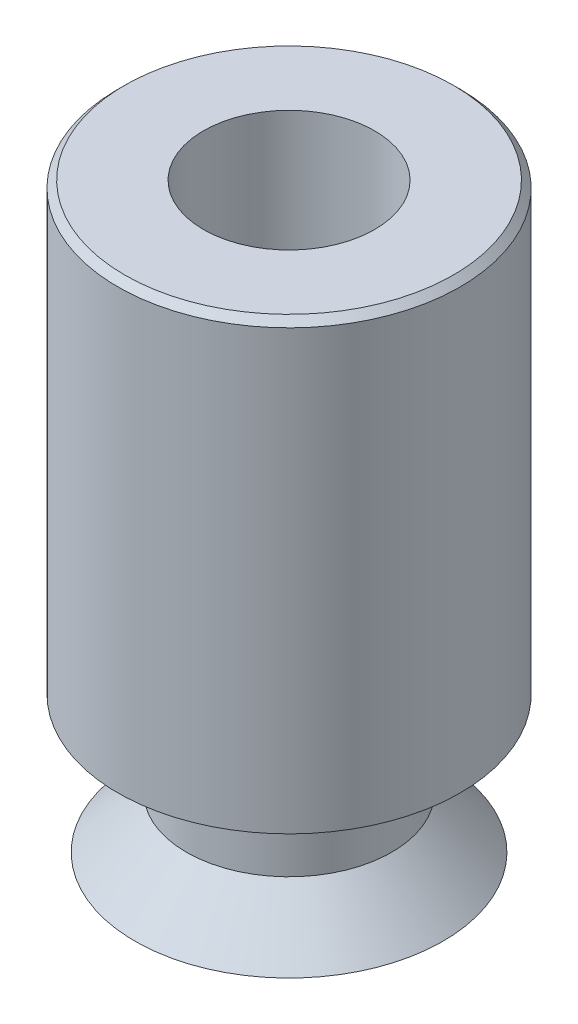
ISO-10303-21;
HEADER;
FILE_DESCRIPTION(('STEP AP214'),'2;1');
FILE_NAME('part.step','',(''),(''),'','','');
FILE_SCHEMA(('AUTOMOTIVE_DESIGN { 1 0 10303 214 1 1 1 1 }'));
ENDSEC;
DATA;
#1=APPLICATION_CONTEXT('core data for automotive mechanical design processes');
#2=APPLICATION_PROTOCOL_DEFINITION('international standard','automotive_design',2000,#1);
#3=PRODUCT_CONTEXT('',#1,'mechanical');
#4=PRODUCT('Part','Part','',(#3));
#5=PRODUCT_RELATED_PRODUCT_CATEGORY('part','',(#4));
#6=PRODUCT_DEFINITION_FORMATION('','',#4);
#7=PRODUCT_DEFINITION_CONTEXT('part definition',#1,'design');
#8=PRODUCT_DEFINITION('design','',#6,#7);
#9=PRODUCT_DEFINITION_SHAPE('','',#8);
#10=(LENGTH_UNIT() NAMED_UNIT(*) SI_UNIT(.MILLI.,.METRE.));
#11=(NAMED_UNIT(*) PLANE_ANGLE_UNIT() SI_UNIT($,.RADIAN.));
#12=(NAMED_UNIT(*) SI_UNIT($,.STERADIAN.) SOLID_ANGLE_UNIT());
#13=UNCERTAINTY_MEASURE_WITH_UNIT(LENGTH_MEASURE(1.E-05),#10,'distance_accuracy_value','');
#14=(GEOMETRIC_REPRESENTATION_CONTEXT(3) GLOBAL_UNCERTAINTY_ASSIGNED_CONTEXT((#13)) GLOBAL_UNIT_ASSIGNED_CONTEXT((#10,
#11,#12)) REPRESENTATION_CONTEXT('',''));
#15=CARTESIAN_POINT('',(0.,0.,0.));
#16=DIRECTION('',(0.,0.,1.));
#17=DIRECTION('',(1.,0.,0.));
#18=AXIS2_PLACEMENT_3D('',#15,#16,#17);
#19=CARTESIAN_POINT('',(0.,17.,0.));
#20=DIRECTION('',(0.,-1.,0.));
#21=DIRECTION('',(0.,0.,-1.));
#22=AXIS2_PLACEMENT_3D('',#19,#20,#21);
#23=PLANE('',#22);
#24=CARTESIAN_POINT('',(0.,17.,0.));
#25=DIRECTION('',(0.,-1.,0.));
#26=DIRECTION('',(0.,0.,-1.));
#27=AXIS2_PLACEMENT_3D('',#24,#25,#26);
#28=CIRCLE('',#27,4.8);
#29=CARTESIAN_POINT('',(0.,17.,-4.8));
#30=VERTEX_POINT('',#29);
#31=EDGE_CURVE('E11',#30,#30,#28,.F.);
#32=ORIENTED_EDGE('',*,*,#31,.T.);
#33=EDGE_LOOP('',(#32));
#34=FACE_BOUND('',#33,.T.);
#35=CARTESIAN_POINT('',(0.,17.,0.));
#36=DIRECTION('',(0.,1.,0.));
#37=DIRECTION('',(0.,0.,1.));
#38=AXIS2_PLACEMENT_3D('',#35,#36,#37);
#39=CIRCLE('',#38,2.5);
#40=CARTESIAN_POINT('',(0.,17.,2.5));
#41=VERTEX_POINT('',#40);
#42=EDGE_CURVE('E52',#41,#41,#39,.T.);
#43=ORIENTED_EDGE('',*,*,#42,.F.);
#44=EDGE_LOOP('',(#43));
#45=FACE_BOUND('',#44,.T.);
#46=ADVANCED_FACE('F33',(#34,#45),#23,.F.);
#47=CARTESIAN_POINT('',(0.,0.,0.));
#48=DIRECTION('',(0.,-1.,0.));
#49=DIRECTION('',(0.,0.,-1.));
#50=AXIS2_PLACEMENT_3D('',#47,#48,#49);
#51=CYLINDRICAL_SURFACE('',#50,5.);
#52=CARTESIAN_POINT('',(0.,16.8,0.));
#53=DIRECTION('',(0.,-1.,0.));
#54=DIRECTION('',(0.,0.,-1.));
#55=AXIS2_PLACEMENT_3D('',#52,#53,#54);
#56=CIRCLE('',#55,5.);
#57=CARTESIAN_POINT('',(0.,16.8,-5.));
#58=VERTEX_POINT('',#57);
#59=EDGE_CURVE('E39',#58,#58,#56,.T.);
#60=ORIENTED_EDGE('',*,*,#59,.T.);
#61=EDGE_LOOP('',(#60));
#62=FACE_BOUND('',#61,.T.);
#63=CARTESIAN_POINT('',(0.,3.99999999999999,0.));
#64=DIRECTION('',(0.,-1.,0.));
#65=DIRECTION('',(0.,0.,-1.));
#66=AXIS2_PLACEMENT_3D('',#63,#64,#65);
#67=CIRCLE('',#66,5.);
#68=CARTESIAN_POINT('',(0.,3.99999999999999,-5.));
#69=VERTEX_POINT('',#68);
#70=EDGE_CURVE('E66',#69,#69,#67,.T.);
#71=ORIENTED_EDGE('',*,*,#70,.F.);
#72=EDGE_LOOP('',(#71));
#73=FACE_BOUND('',#72,.T.);
#74=ADVANCED_FACE('F71',(#62,#73),#51,.T.);
#75=CARTESIAN_POINT('',(-5.,3.99999999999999,0.));
#76=DIRECTION('',(0.,1.,0.));
#77=DIRECTION('',(0.,0.,1.));
#78=AXIS2_PLACEMENT_3D('',#75,#76,#77);
#79=PLANE('',#78);
#80=CARTESIAN_POINT('',(0.,3.99999999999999,0.));
#81=DIRECTION('',(0.,-1.,0.));
#82=DIRECTION('',(0.,0.,-1.));
#83=AXIS2_PLACEMENT_3D('',#80,#81,#82);
#84=CIRCLE('',#83,3.);
#85=CARTESIAN_POINT('',(0.,3.99999999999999,-3.));
#86=VERTEX_POINT('',#85);
#87=EDGE_CURVE('E63',#86,#86,#84,.T.);
#88=ORIENTED_EDGE('',*,*,#87,.F.);
#89=EDGE_LOOP('',(#88));
#90=FACE_BOUND('',#89,.T.);
#91=ORIENTED_EDGE('',*,*,#70,.T.);
#92=EDGE_LOOP('',(#91));
#93=FACE_BOUND('',#92,.T.);
#94=ADVANCED_FACE('F85',(#90,#93),#79,.F.);
#95=CARTESIAN_POINT('',(0.,0.,0.));
#96=DIRECTION('',(0.,-1.,0.));
#97=DIRECTION('',(0.,0.,-1.));
#98=AXIS2_PLACEMENT_3D('',#95,#96,#97);
#99=CYLINDRICAL_SURFACE('',#98,3.);
#100=CARTESIAN_POINT('',(0.,1.49999999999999,0.));
#101=DIRECTION('',(0.,-1.,0.));
#102=DIRECTION('',(0.,0.,-1.));
#103=AXIS2_PLACEMENT_3D('',#100,#101,#102);
#104=CIRCLE('',#103,3.);
#105=CARTESIAN_POINT('',(0.,1.49999999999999,-3.));
#106=VERTEX_POINT('',#105);
#107=EDGE_CURVE('E60',#106,#106,#104,.T.);
#108=ORIENTED_EDGE('',*,*,#107,.F.);
#109=EDGE_LOOP('',(#108));
#110=FACE_BOUND('',#109,.T.);
#111=ORIENTED_EDGE('',*,*,#87,.T.);
#112=EDGE_LOOP('',(#111));
#113=FACE_BOUND('',#112,.T.);
#114=ADVANCED_FACE('F101',(#110,#113),#99,.T.);
#115=CARTESIAN_POINT('',(0.,1.49999999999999,0.));
#116=DIRECTION('',(0.,-1.,0.));
#117=DIRECTION('',(0.,0.,-1.));
#118=AXIS2_PLACEMENT_3D('',#115,#116,#117);
#119=CONICAL_SURFACE('',#118,3.,0.785398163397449);
#120=CARTESIAN_POINT('',(0.,0.,0.));
#121=DIRECTION('',(0.,-1.,0.));
#122=DIRECTION('',(0.,0.,-1.));
#123=AXIS2_PLACEMENT_3D('',#120,#121,#122);
#124=CIRCLE('',#123,4.5);
#125=CARTESIAN_POINT('',(0.,0.,-4.5));
#126=VERTEX_POINT('',#125);
#127=EDGE_CURVE('E55',#126,#126,#124,.T.);
#128=ORIENTED_EDGE('',*,*,#127,.F.);
#129=EDGE_LOOP('',(#128));
#130=FACE_BOUND('',#129,.T.);
#131=ORIENTED_EDGE('',*,*,#107,.T.);
#132=EDGE_LOOP('',(#131));
#133=FACE_BOUND('',#132,.T.);
#134=ADVANCED_FACE('F95',(#130,#133),#119,.T.);
#135=CARTESIAN_POINT('',(-4.5,0.,0.));
#136=DIRECTION('',(0.,1.,0.));
#137=DIRECTION('',(0.,0.,1.));
#138=AXIS2_PLACEMENT_3D('',#135,#136,#137);
#139=PLANE('',#138);
#140=ORIENTED_EDGE('',*,*,#127,.T.);
#141=EDGE_LOOP('',(#140));
#142=FACE_BOUND('',#141,.T.);
#143=ADVANCED_FACE('F90',(#142),#139,.F.);
#144=CARTESIAN_POINT('',(0.,17.,0.));
#145=DIRECTION('',(0.,1.,0.));
#146=DIRECTION('',(0.,0.,1.));
#147=AXIS2_PLACEMENT_3D('',#144,#145,#146);
#148=CYLINDRICAL_SURFACE('',#147,2.5);
#149=CARTESIAN_POINT('',(0.,3.99999999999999,0.));
#150=DIRECTION('',(0.,1.,0.));
#151=DIRECTION('',(0.,0.,1.));
#152=AXIS2_PLACEMENT_3D('',#149,#150,#151);
#153=CIRCLE('',#152,2.5);
#154=CARTESIAN_POINT('',(0.,3.99999999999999,2.5));
#155=VERTEX_POINT('',#154);
#156=EDGE_CURVE('E50',#155,#155,#153,.T.);
#157=ORIENTED_EDGE('',*,*,#156,.F.);
#158=EDGE_LOOP('',(#157));
#159=FACE_BOUND('',#158,.T.);
#160=ORIENTED_EDGE('',*,*,#42,.T.);
#161=EDGE_LOOP('',(#160));
#162=FACE_BOUND('',#161,.T.);
#163=ADVANCED_FACE('F46',(#159,#162),#148,.F.);
#164=CARTESIAN_POINT('',(0.,3.99999999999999,0.));
#165=DIRECTION('',(0.,1.,0.));
#166=DIRECTION('',(0.,0.,1.));
#167=AXIS2_PLACEMENT_3D('',#164,#165,#166);
#168=CONICAL_SURFACE('',#167,2.5,1.0471975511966);
#169=CARTESIAN_POINT('',(0.,2.55662432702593,0.));
#170=VERTEX_POINT('',#169);
#171=VERTEX_LOOP('',#170);
#172=FACE_BOUND('',#171,.T.);
#173=ORIENTED_EDGE('',*,*,#156,.T.);
#174=EDGE_LOOP('',(#173));
#175=FACE_BOUND('',#174,.T.);
#176=ADVANCED_FACE('F42',(#172,#175),#168,.F.);
#177=CARTESIAN_POINT('',(0.,16.8,0.));
#178=DIRECTION('',(0.,-1.,0.));
#179=DIRECTION('',(0.,0.,-1.));
#180=AXIS2_PLACEMENT_3D('',#177,#178,#179);
#181=CONICAL_SURFACE('',#180,5.,0.785398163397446);
#182=ORIENTED_EDGE('',*,*,#31,.F.);
#183=EDGE_LOOP('',(#182));
#184=FACE_BOUND('',#183,.T.);
#185=ORIENTED_EDGE('',*,*,#59,.F.);
#186=EDGE_LOOP('',(#185));
#187=FACE_BOUND('',#186,.T.);
#188=ADVANCED_FACE('F45',(#184,#187),#181,.T.);
#189=CLOSED_SHELL('',(#46,#74,#94,#114,#134,#143,#163,#176,#188));
#190=MANIFOLD_SOLID_BREP('B2',#189);
#191=ADVANCED_BREP_SHAPE_REPRESENTATION('',(#18,#190),#14);
#192=SHAPE_DEFINITION_REPRESENTATION(#9,#191);
ENDSEC;
END-ISO-10303-21;
